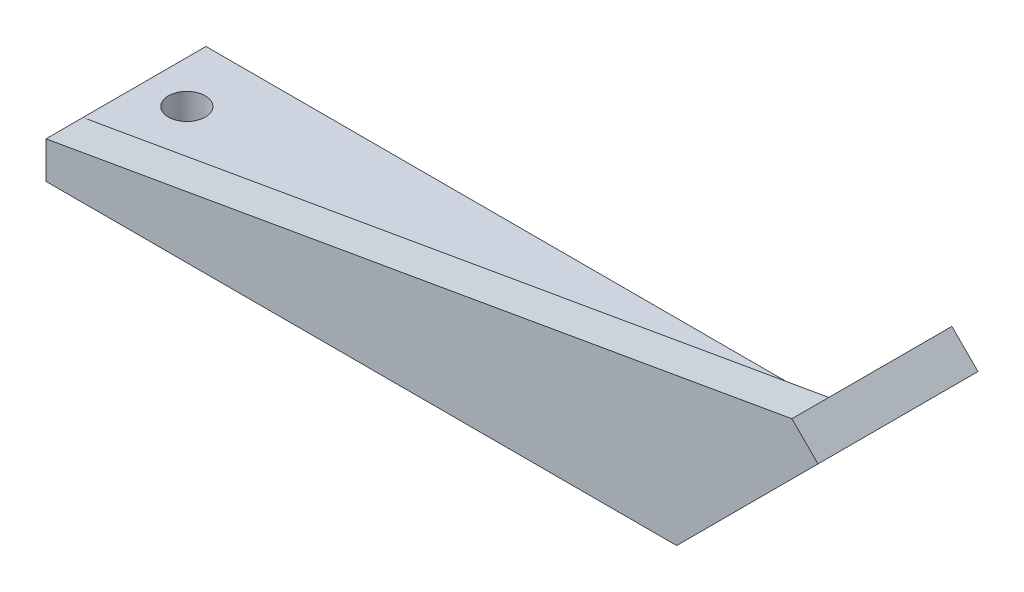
ISO-10303-21;
HEADER;
FILE_DESCRIPTION(('STEP AP214'),'2;1');
FILE_NAME('part.step','',(''),(''),'','','');
FILE_SCHEMA(('AUTOMOTIVE_DESIGN { 1 0 10303 214 1 1 1 1 }'));
ENDSEC;
DATA;
#1=APPLICATION_CONTEXT('core data for automotive mechanical design processes');
#2=APPLICATION_PROTOCOL_DEFINITION('international standard','automotive_design',2000,#1);
#3=PRODUCT_CONTEXT('',#1,'mechanical');
#4=PRODUCT('Part','Part','',(#3));
#5=PRODUCT_RELATED_PRODUCT_CATEGORY('part','',(#4));
#6=PRODUCT_DEFINITION_FORMATION('','',#4);
#7=PRODUCT_DEFINITION_CONTEXT('part definition',#1,'design');
#8=PRODUCT_DEFINITION('design','',#6,#7);
#9=PRODUCT_DEFINITION_SHAPE('','',#8);
#10=(LENGTH_UNIT() NAMED_UNIT(*) SI_UNIT(.MILLI.,.METRE.));
#11=(NAMED_UNIT(*) PLANE_ANGLE_UNIT() SI_UNIT($,.RADIAN.));
#12=(NAMED_UNIT(*) SI_UNIT($,.STERADIAN.) SOLID_ANGLE_UNIT());
#13=UNCERTAINTY_MEASURE_WITH_UNIT(LENGTH_MEASURE(1.E-05),#10,'distance_accuracy_value','');
#14=(GEOMETRIC_REPRESENTATION_CONTEXT(3) GLOBAL_UNCERTAINTY_ASSIGNED_CONTEXT((#13)) GLOBAL_UNIT_ASSIGNED_CONTEXT((#10,
#11,#12)) REPRESENTATION_CONTEXT('',''));
#15=CARTESIAN_POINT('',(0.,0.,0.));
#16=DIRECTION('',(0.,0.,1.));
#17=DIRECTION('',(1.,0.,0.));
#18=AXIS2_PLACEMENT_3D('',#15,#16,#17);
#19=CARTESIAN_POINT('',(0.,0.,10.));
#20=DIRECTION('',(0.,-1.,0.));
#21=DIRECTION('',(1.,0.,0.));
#22=AXIS2_PLACEMENT_3D('',#19,#20,#21);
#23=PLANE('',#22);
#24=CARTESIAN_POINT('',(-46.55735931,0.,15.));
#25=DIRECTION('',(0.,1.,0.));
#26=DIRECTION('',(-1.,0.,0.));
#27=AXIS2_PLACEMENT_3D('',#24,#25,#26);
#28=CIRCLE('',#27,1.5);
#29=CARTESIAN_POINT('',(-48.05735931,0.,15.));
#30=VERTEX_POINT('',#29);
#31=EDGE_CURVE('E158',#30,#30,#28,.T.);
#32=ORIENTED_EDGE('',*,*,#31,.F.);
#33=EDGE_LOOP('',(#32));
#34=FACE_BOUND('',#33,.T.);
#35=DIRECTION('',(1.,0.,0.));
#36=VECTOR('',#35,1.);
#37=CARTESIAN_POINT('',(0.,0.,10.));
#38=LINE('',#37,#36);
#39=CARTESIAN_POINT('',(-50.,0.,10.));
#40=VERTEX_POINT('',#39);
#41=CARTESIAN_POINT('',(0.,0.,10.));
#42=VERTEX_POINT('',#41);
#43=EDGE_CURVE('E50',#40,#42,#38,.T.);
#44=ORIENTED_EDGE('',*,*,#43,.F.);
#45=DIRECTION('',(0.,0.,-1.));
#46=VECTOR('',#45,1.);
#47=CARTESIAN_POINT('',(-50.,0.,10.));
#48=LINE('',#47,#46);
#49=CARTESIAN_POINT('',(-50.,0.,20.));
#50=VERTEX_POINT('',#49);
#51=EDGE_CURVE('E44',#50,#40,#48,.T.);
#52=ORIENTED_EDGE('',*,*,#51,.F.);
#53=DIRECTION('',(-1.,0.,0.));
#54=VECTOR('',#53,1.);
#55=CARTESIAN_POINT('',(0.,0.,20.));
#56=LINE('',#55,#54);
#57=CARTESIAN_POINT('',(0.,0.,20.));
#58=VERTEX_POINT('',#57);
#59=EDGE_CURVE('E126',#58,#50,#56,.T.);
#60=ORIENTED_EDGE('',*,*,#59,.F.);
#61=DIRECTION('',(0.,0.,-1.));
#62=VECTOR('',#61,1.);
#63=CARTESIAN_POINT('',(0.,0.,10.));
#64=LINE('',#63,#62);
#65=EDGE_CURVE('E101',#58,#42,#64,.T.);
#66=ORIENTED_EDGE('',*,*,#65,.T.);
#67=EDGE_LOOP('',(#44,#52,#60,#66));
#68=FACE_BOUND('',#67,.T.);
#69=ADVANCED_FACE('F36',(#34,#68),#23,.F.);
#70=CARTESIAN_POINT('',(-50.,0.,10.));
#71=DIRECTION('',(1.,0.,0.));
#72=DIRECTION('',(0.,0.,-1.));
#73=AXIS2_PLACEMENT_3D('',#70,#71,#72);
#74=PLANE('',#73);
#75=DIRECTION('',(0.,-1.,0.));
#76=VECTOR('',#75,1.);
#77=CARTESIAN_POINT('',(-50.,30.,10.));
#78=LINE('',#77,#76);
#79=CARTESIAN_POINT('',(-50.,-3.00000000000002,10.));
#80=VERTEX_POINT('',#79);
#81=EDGE_CURVE('E91',#40,#80,#78,.T.);
#82=ORIENTED_EDGE('',*,*,#81,.T.);
#83=DIRECTION('',(0.,0.,-1.));
#84=VECTOR('',#83,1.);
#85=CARTESIAN_POINT('',(-50.,-3.00000000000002,10.));
#86=LINE('',#85,#84);
#87=CARTESIAN_POINT('',(-50.,-3.00000000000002,23.));
#88=VERTEX_POINT('',#87);
#89=EDGE_CURVE('E109',#88,#80,#86,.T.);
#90=ORIENTED_EDGE('',*,*,#89,.F.);
#91=DIRECTION('',(0.,1.,0.));
#92=VECTOR('',#91,1.);
#93=CARTESIAN_POINT('',(-50.,0.,23.));
#94=LINE('',#93,#92);
#95=CARTESIAN_POINT('',(-50.,0.,23.));
#96=VERTEX_POINT('',#95);
#97=EDGE_CURVE('E143',#88,#96,#94,.T.);
#98=ORIENTED_EDGE('',*,*,#97,.T.);
#99=DIRECTION('',(0.,0.,-1.));
#100=VECTOR('',#99,1.);
#101=CARTESIAN_POINT('',(-50.,0.,23.));
#102=LINE('',#101,#100);
#103=EDGE_CURVE('E107',#96,#50,#102,.T.);
#104=ORIENTED_EDGE('',*,*,#103,.T.);
#105=ORIENTED_EDGE('',*,*,#51,.T.);
#106=EDGE_LOOP('',(#82,#90,#98,#104,#105));
#107=FACE_BOUND('',#106,.T.);
#108=ADVANCED_FACE('F105',(#107),#74,.F.);
#109=CARTESIAN_POINT('',(-50.,-3.00000000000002,10.));
#110=DIRECTION('',(0.,1.,0.));
#111=DIRECTION('',(-1.,0.,0.));
#112=AXIS2_PLACEMENT_3D('',#109,#110,#111);
#113=PLANE('',#112);
#114=CARTESIAN_POINT('',(-46.55735931,-3.00000000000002,15.));
#115=DIRECTION('',(0.,1.,0.));
#116=DIRECTION('',(-1.,0.,0.));
#117=AXIS2_PLACEMENT_3D('',#114,#115,#116);
#118=CIRCLE('',#117,1.5);
#119=CARTESIAN_POINT('',(-48.05735931,-3.00000000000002,15.));
#120=VERTEX_POINT('',#119);
#121=EDGE_CURVE('E39',#120,#120,#118,.T.);
#122=ORIENTED_EDGE('',*,*,#121,.T.);
#123=EDGE_LOOP('',(#122));
#124=FACE_BOUND('',#123,.T.);
#125=DIRECTION('',(-1.,0.,0.));
#126=VECTOR('',#125,1.);
#127=CARTESIAN_POINT('',(-50.,-3.00000000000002,10.));
#128=LINE('',#127,#126);
#129=CARTESIAN_POINT('',(1.24264068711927,-3.00000000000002,10.));
#130=VERTEX_POINT('',#129);
#131=EDGE_CURVE('E94',#130,#80,#128,.T.);
#132=ORIENTED_EDGE('',*,*,#131,.F.);
#133=DIRECTION('',(0.,0.,-1.));
#134=VECTOR('',#133,1.);
#135=CARTESIAN_POINT('',(1.24264068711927,-3.00000000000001,10.));
#136=LINE('',#135,#134);
#137=CARTESIAN_POINT('',(1.24264068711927,-3.00000000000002,23.));
#138=VERTEX_POINT('',#137);
#139=EDGE_CURVE('E111',#138,#130,#136,.T.);
#140=ORIENTED_EDGE('',*,*,#139,.F.);
#141=DIRECTION('',(-1.,0.,0.));
#142=VECTOR('',#141,1.);
#143=CARTESIAN_POINT('',(-50.,-3.00000000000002,23.));
#144=LINE('',#143,#142);
#145=EDGE_CURVE('E140',#138,#88,#144,.T.);
#146=ORIENTED_EDGE('',*,*,#145,.T.);
#147=ORIENTED_EDGE('',*,*,#89,.T.);
#148=EDGE_LOOP('',(#132,#140,#146,#147));
#149=FACE_BOUND('',#148,.T.);
#150=ADVANCED_FACE('F165',(#124,#149),#113,.F.);
#151=CARTESIAN_POINT('',(12.7279220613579,8.4852813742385,10.));
#152=DIRECTION('',(-0.707106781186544,0.707106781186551,0.));
#153=DIRECTION('',(-0.707106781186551,-0.707106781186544,0.));
#154=AXIS2_PLACEMENT_3D('',#151,#152,#153);
#155=PLANE('',#154);
#156=CARTESIAN_POINT('',(7.65796644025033,3.41532575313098,15.));
#157=DIRECTION('',(0.707106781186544,-0.707106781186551,0.));
#158=DIRECTION('',(-0.707106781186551,-0.707106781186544,0.));
#159=AXIS2_PLACEMENT_3D('',#156,#157,#158);
#160=CIRCLE('',#159,1.5);
#161=CARTESIAN_POINT('',(6.5973062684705,2.35466558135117,15.));
#162=VERTEX_POINT('',#161);
#163=EDGE_CURVE('E137',#162,#162,#160,.T.);
#164=ORIENTED_EDGE('',*,*,#163,.F.);
#165=EDGE_LOOP('',(#164));
#166=FACE_BOUND('',#165,.T.);
#167=DIRECTION('',(-0.707106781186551,-0.707106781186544,0.));
#168=VECTOR('',#167,1.);
#169=CARTESIAN_POINT('',(12.7279220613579,8.4852813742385,10.));
#170=LINE('',#169,#168);
#171=CARTESIAN_POINT('',(12.7279220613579,8.4852813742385,10.));
#172=VERTEX_POINT('',#171);
#173=EDGE_CURVE('E155',#172,#130,#170,.T.);
#174=ORIENTED_EDGE('',*,*,#173,.F.);
#175=DIRECTION('',(0.,0.,-1.));
#176=VECTOR('',#175,1.);
#177=CARTESIAN_POINT('',(12.7279220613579,8.4852813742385,10.));
#178=LINE('',#177,#176);
#179=CARTESIAN_POINT('',(12.7279220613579,8.4852813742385,23.));
#180=VERTEX_POINT('',#179);
#181=EDGE_CURVE('E116',#180,#172,#178,.T.);
#182=ORIENTED_EDGE('',*,*,#181,.F.);
#183=DIRECTION('',(-0.707106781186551,-0.707106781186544,0.));
#184=VECTOR('',#183,1.);
#185=CARTESIAN_POINT('',(1.24264068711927,-3.00000000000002,23.));
#186=LINE('',#185,#184);
#187=EDGE_CURVE('E132',#180,#138,#186,.T.);
#188=ORIENTED_EDGE('',*,*,#187,.T.);
#189=ORIENTED_EDGE('',*,*,#139,.T.);
#190=EDGE_LOOP('',(#174,#182,#188,#189));
#191=FACE_BOUND('',#190,.T.);
#192=ADVANCED_FACE('F184',(#166,#191),#155,.F.);
#193=CARTESIAN_POINT('',(10.6066017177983,10.6066017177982,10.));
#194=DIRECTION('',(-0.707106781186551,-0.707106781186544,0.));
#195=DIRECTION('',(0.707106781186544,-0.707106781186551,0.));
#196=AXIS2_PLACEMENT_3D('',#193,#194,#195);
#197=PLANE('',#196);
#198=DIRECTION('',(0.707106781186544,-0.707106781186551,0.));
#199=VECTOR('',#198,1.);
#200=CARTESIAN_POINT('',(10.6066017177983,10.6066017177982,10.));
#201=LINE('',#200,#199);
#202=CARTESIAN_POINT('',(10.6066017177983,10.6066017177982,10.));
#203=VERTEX_POINT('',#202);
#204=EDGE_CURVE('E97',#203,#172,#201,.T.);
#205=ORIENTED_EDGE('',*,*,#204,.F.);
#206=DIRECTION('',(0.,0.,-1.));
#207=VECTOR('',#206,1.);
#208=CARTESIAN_POINT('',(10.6066017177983,10.6066017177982,10.));
#209=LINE('',#208,#207);
#210=CARTESIAN_POINT('',(10.6066017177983,10.6066017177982,20.));
#211=VERTEX_POINT('',#210);
#212=EDGE_CURVE('E119',#211,#203,#209,.T.);
#213=ORIENTED_EDGE('',*,*,#212,.F.);
#214=DIRECTION('',(0.,0.,-1.));
#215=VECTOR('',#214,1.);
#216=CARTESIAN_POINT('',(10.6066017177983,10.6066017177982,23.));
#217=LINE('',#216,#215);
#218=CARTESIAN_POINT('',(10.6066017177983,10.6066017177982,23.));
#219=VERTEX_POINT('',#218);
#220=EDGE_CURVE('E128',#219,#211,#217,.T.);
#221=ORIENTED_EDGE('',*,*,#220,.F.);
#222=DIRECTION('',(0.707106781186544,-0.707106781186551,0.));
#223=VECTOR('',#222,1.);
#224=CARTESIAN_POINT('',(12.7279220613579,8.4852813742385,23.));
#225=LINE('',#224,#223);
#226=EDGE_CURVE('E136',#219,#180,#225,.T.);
#227=ORIENTED_EDGE('',*,*,#226,.T.);
#228=ORIENTED_EDGE('',*,*,#181,.T.);
#229=EDGE_LOOP('',(#205,#213,#221,#227,#228));
#230=FACE_BOUND('',#229,.T.);
#231=ADVANCED_FACE('F189',(#230),#197,.F.);
#232=CARTESIAN_POINT('',(0.,0.,10.));
#233=DIRECTION('',(0.707106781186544,-0.707106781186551,0.));
#234=DIRECTION('',(0.707106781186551,0.707106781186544,0.));
#235=AXIS2_PLACEMENT_3D('',#232,#233,#234);
#236=PLANE('',#235);
#237=CARTESIAN_POINT('',(5.53664609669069,5.53664609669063,15.));
#238=DIRECTION('',(0.707106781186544,-0.707106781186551,0.));
#239=DIRECTION('',(-0.707106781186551,-0.707106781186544,0.));
#240=AXIS2_PLACEMENT_3D('',#237,#238,#239);
#241=CIRCLE('',#240,1.5);
#242=CARTESIAN_POINT('',(4.47598592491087,4.47598592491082,15.));
#243=VERTEX_POINT('',#242);
#244=EDGE_CURVE('E102',#243,#243,#241,.T.);
#245=ORIENTED_EDGE('',*,*,#244,.T.);
#246=EDGE_LOOP('',(#245));
#247=FACE_BOUND('',#246,.T.);
#248=DIRECTION('',(0.707106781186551,0.707106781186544,0.));
#249=VECTOR('',#248,1.);
#250=CARTESIAN_POINT('',(0.,0.,10.));
#251=LINE('',#250,#249);
#252=EDGE_CURVE('E11',#42,#203,#251,.T.);
#253=ORIENTED_EDGE('',*,*,#252,.F.);
#254=ORIENTED_EDGE('',*,*,#65,.F.);
#255=DIRECTION('',(-0.707106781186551,-0.707106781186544,0.));
#256=VECTOR('',#255,1.);
#257=CARTESIAN_POINT('',(0.,0.,20.));
#258=LINE('',#257,#256);
#259=EDGE_CURVE('E123',#211,#58,#258,.T.);
#260=ORIENTED_EDGE('',*,*,#259,.F.);
#261=ORIENTED_EDGE('',*,*,#212,.T.);
#262=EDGE_LOOP('',(#253,#254,#260,#261));
#263=FACE_BOUND('',#262,.T.);
#264=ADVANCED_FACE('F193',(#247,#263),#236,.F.);
#265=CARTESIAN_POINT('',(0.,0.,20.));
#266=DIRECTION('',(0.,0.,1.));
#267=DIRECTION('',(-1.,0.,0.));
#268=AXIS2_PLACEMENT_3D('',#265,#266,#267);
#269=PLANE('',#268);
#270=ORIENTED_EDGE('',*,*,#259,.T.);
#271=ORIENTED_EDGE('',*,*,#59,.T.);
#272=DIRECTION('',(0.985029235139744,0.172387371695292,0.));
#273=VECTOR('',#272,1.);
#274=CARTESIAN_POINT('',(10.6066017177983,10.6066017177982,20.));
#275=LINE('',#274,#273);
#276=EDGE_CURVE('E133',#50,#211,#275,.T.);
#277=ORIENTED_EDGE('',*,*,#276,.T.);
#278=EDGE_LOOP('',(#270,#271,#277));
#279=FACE_BOUND('',#278,.T.);
#280=ADVANCED_FACE('F197',(#279),#269,.F.);
#281=CARTESIAN_POINT('',(10.6066017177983,10.6066017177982,23.));
#282=DIRECTION('',(-0.172387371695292,0.985029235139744,0.));
#283=DIRECTION('',(-0.985029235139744,-0.172387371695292,0.));
#284=AXIS2_PLACEMENT_3D('',#281,#282,#283);
#285=PLANE('',#284);
#286=ORIENTED_EDGE('',*,*,#276,.F.);
#287=ORIENTED_EDGE('',*,*,#103,.F.);
#288=DIRECTION('',(0.985029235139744,0.172387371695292,0.));
#289=VECTOR('',#288,1.);
#290=CARTESIAN_POINT('',(10.6066017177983,10.6066017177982,23.));
#291=LINE('',#290,#289);
#292=EDGE_CURVE('E145',#96,#219,#291,.T.);
#293=ORIENTED_EDGE('',*,*,#292,.T.);
#294=ORIENTED_EDGE('',*,*,#220,.T.);
#295=EDGE_LOOP('',(#286,#287,#293,#294));
#296=FACE_BOUND('',#295,.T.);
#297=ADVANCED_FACE('F199',(#296),#285,.T.);
#298=CARTESIAN_POINT('',(0.,0.,23.));
#299=DIRECTION('',(0.,0.,1.));
#300=DIRECTION('',(-1.,0.,0.));
#301=AXIS2_PLACEMENT_3D('',#298,#299,#300);
#302=PLANE('',#301);
#303=ORIENTED_EDGE('',*,*,#226,.F.);
#304=ORIENTED_EDGE('',*,*,#292,.F.);
#305=ORIENTED_EDGE('',*,*,#97,.F.);
#306=ORIENTED_EDGE('',*,*,#145,.F.);
#307=ORIENTED_EDGE('',*,*,#187,.F.);
#308=EDGE_LOOP('',(#303,#304,#305,#306,#307));
#309=FACE_BOUND('',#308,.T.);
#310=ADVANCED_FACE('F202',(#309),#302,.T.);
#311=CARTESIAN_POINT('',(7.65796644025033,3.41532575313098,15.));
#312=DIRECTION('',(-0.707106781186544,0.707106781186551,0.));
#313=DIRECTION('',(-0.707106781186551,-0.707106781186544,0.));
#314=AXIS2_PLACEMENT_3D('',#311,#312,#313);
#315=CYLINDRICAL_SURFACE('',#314,1.5);
#316=ORIENTED_EDGE('',*,*,#163,.T.);
#317=EDGE_LOOP('',(#316));
#318=FACE_BOUND('',#317,.T.);
#319=ORIENTED_EDGE('',*,*,#244,.F.);
#320=EDGE_LOOP('',(#319));
#321=FACE_BOUND('',#320,.T.);
#322=ADVANCED_FACE('F174',(#318,#321),#315,.F.);
#323=CARTESIAN_POINT('',(-50.,30.,10.));
#324=DIRECTION('',(0.,0.,-1.));
#325=DIRECTION('',(-1.,0.,0.));
#326=AXIS2_PLACEMENT_3D('',#323,#324,#325);
#327=PLANE('',#326);
#328=ORIENTED_EDGE('',*,*,#43,.T.);
#329=ORIENTED_EDGE('',*,*,#252,.T.);
#330=ORIENTED_EDGE('',*,*,#204,.T.);
#331=ORIENTED_EDGE('',*,*,#173,.T.);
#332=ORIENTED_EDGE('',*,*,#131,.T.);
#333=ORIENTED_EDGE('',*,*,#81,.F.);
#334=EDGE_LOOP('',(#328,#329,#330,#331,#332,#333));
#335=FACE_BOUND('',#334,.T.);
#336=ADVANCED_FACE('F92',(#335),#327,.T.);
#337=CARTESIAN_POINT('',(-46.55735931,-30.,15.));
#338=DIRECTION('',(0.,1.,0.));
#339=DIRECTION('',(-1.,0.,0.));
#340=AXIS2_PLACEMENT_3D('',#337,#338,#339);
#341=CYLINDRICAL_SURFACE('',#340,1.5);
#342=ORIENTED_EDGE('',*,*,#31,.T.);
#343=EDGE_LOOP('',(#342));
#344=FACE_BOUND('',#343,.T.);
#345=ORIENTED_EDGE('',*,*,#121,.F.);
#346=EDGE_LOOP('',(#345));
#347=FACE_BOUND('',#346,.T.);
#348=ADVANCED_FACE('F168',(#344,#347),#341,.F.);
#349=CLOSED_SHELL('',(#69,#108,#150,#192,#231,#264,#280,#297,#310,#322,#336,#348));
#350=MANIFOLD_SOLID_BREP('B2',#349);
#351=ADVANCED_BREP_SHAPE_REPRESENTATION('',(#18,#350),#14);
#352=SHAPE_DEFINITION_REPRESENTATION(#9,#351);
ENDSEC;
END-ISO-10303-21;
